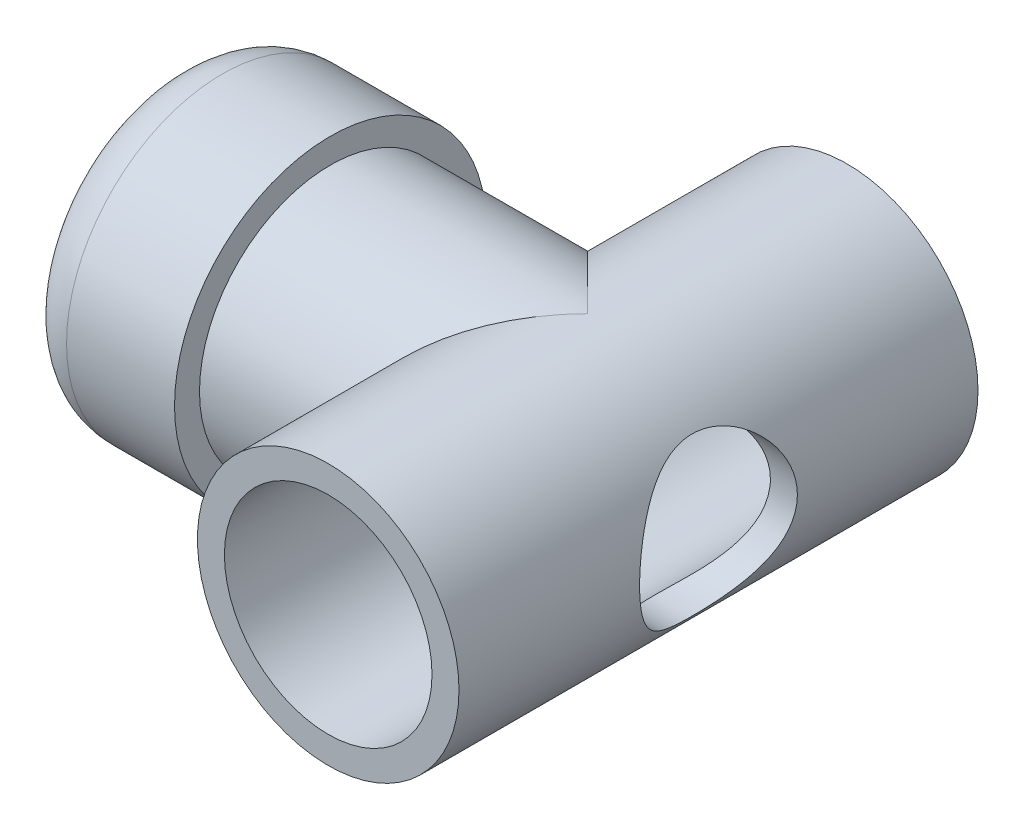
from build123d import *

# Parameters (mm, degrees)
BASE_EXTRUDE_DEPTH      = 7.9375
BASE_EXTRUDE_DEPTH_BACK = 7.9375
SKETCH1_R               = 4.0005
SKETCH4_R               = 4.0005
BOSS_EXTRUDE1_DEPTH     = 12.7
SKETCH5_R               = 3.175
CUT_EXTRUDE2_DEPTH      = 21.719788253
SKETCH6_R               = 2.413
CUT_EXTRUDE3_DEPTH      = 19.918631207
SKETCH7_R               = 4.764591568
SKETCH7_R_2             = 2.413
BOSS_EXTRUDE2_DEPTH     = 4.826
FILLET1_R               = 1.524


with BuildPart() as part:
    # Sketch1 → Base-Extrude (new, two sides: drawn at the far end of the back side and taken through both)
    with BuildSketch(Plane.XY.offset(-BASE_EXTRUDE_DEPTH_BACK)):
        Circle(SKETCH1_R)
    extrude(amount=BASE_EXTRUDE_DEPTH + BASE_EXTRUDE_DEPTH_BACK)

    # Sketch4 → Boss-Extrude1 (add)
    with BuildSketch(Plane(origin=(0, 0, 0), x_dir=(0, 0, -1), z_dir=(1, 0, 0))):
        with Locations(Location((0, 0, 0), (0, 0, 270))):
            Circle(SKETCH4_R)
    extrude(amount=-BOSS_EXTRUDE1_DEPTH)

    # Sketch5 → Cut-Extrude2 (cut, through all)
    with BuildSketch(Plane.XY.offset(7.9375)):
        Circle(SKETCH5_R)
    extrude(amount=-CUT_EXTRUDE2_DEPTH, mode=Mode.SUBTRACT)

    # Sketch6 → Cut-Extrude3 (cut, through all)
    with BuildSketch(Plane.ZY.offset(12.7)):
        Circle(SKETCH6_R)
    extrude(amount=-CUT_EXTRUDE3_DEPTH, mode=Mode.SUBTRACT)

    # Sketch7 → Boss-Extrude2 (add)
    with BuildSketch(Plane.ZY.offset(12.7)):
        Circle(SKETCH7_R)
        Circle(SKETCH7_R_2, mode=Mode.SUBTRACT)
    extrude(amount=-BOSS_EXTRUDE2_DEPTH)

    # Fillet1
    fillet1_edges = [part.edges().sort_by_distance(p)[0] for p in [
        (-12.7, 0, -4.764591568),
    ]]
    fillet(fillet1_edges, radius=FILLET1_R)


solid = part.part
